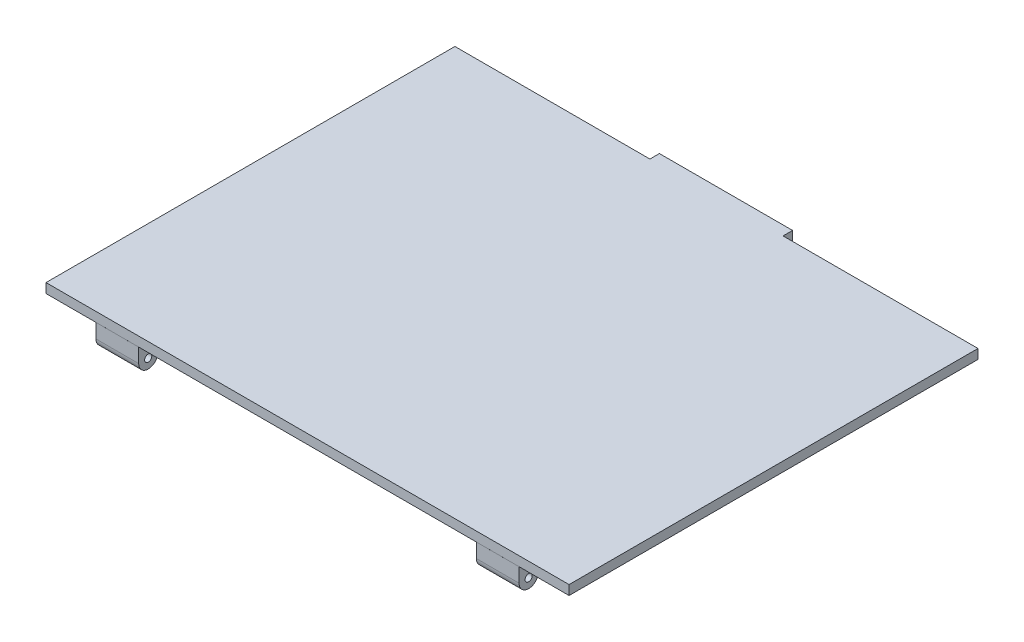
ISO-10303-21;
HEADER;
FILE_DESCRIPTION(('STEP AP214'),'2;1');
FILE_NAME('part.step','',(''),(''),'','','');
FILE_SCHEMA(('AUTOMOTIVE_DESIGN { 1 0 10303 214 1 1 1 1 }'));
ENDSEC;
DATA;
#1=APPLICATION_CONTEXT('core data for automotive mechanical design processes');
#2=APPLICATION_PROTOCOL_DEFINITION('international standard','automotive_design',2000,#1);
#3=PRODUCT_CONTEXT('',#1,'mechanical');
#4=PRODUCT('Part','Part','',(#3));
#5=PRODUCT_RELATED_PRODUCT_CATEGORY('part','',(#4));
#6=PRODUCT_DEFINITION_FORMATION('','',#4);
#7=PRODUCT_DEFINITION_CONTEXT('part definition',#1,'design');
#8=PRODUCT_DEFINITION('design','',#6,#7);
#9=PRODUCT_DEFINITION_SHAPE('','',#8);
#10=(LENGTH_UNIT() NAMED_UNIT(*) SI_UNIT(.MILLI.,.METRE.));
#11=(NAMED_UNIT(*) PLANE_ANGLE_UNIT() SI_UNIT($,.RADIAN.));
#12=(NAMED_UNIT(*) SI_UNIT($,.STERADIAN.) SOLID_ANGLE_UNIT());
#13=UNCERTAINTY_MEASURE_WITH_UNIT(LENGTH_MEASURE(1.E-05),#10,'distance_accuracy_value','');
#14=(GEOMETRIC_REPRESENTATION_CONTEXT(3) GLOBAL_UNCERTAINTY_ASSIGNED_CONTEXT((#13)) GLOBAL_UNIT_ASSIGNED_CONTEXT((#10,
#11,#12)) REPRESENTATION_CONTEXT('',''));
#15=CARTESIAN_POINT('',(0.,0.,0.));
#16=DIRECTION('',(0.,0.,1.));
#17=DIRECTION('',(1.,0.,0.));
#18=AXIS2_PLACEMENT_3D('',#15,#16,#17);
#19=CARTESIAN_POINT('',(0.,0.,0.));
#20=DIRECTION('',(0.,-1.,0.));
#21=DIRECTION('',(0.,0.,-1.));
#22=AXIS2_PLACEMENT_3D('',#19,#20,#21);
#23=PLANE('',#22);
#24=DIRECTION('',(-1.,0.,0.));
#25=VECTOR('',#24,1.);
#26=CARTESIAN_POINT('',(94.5910035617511,0.,-84.5623146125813));
#27=LINE('',#26,#25);
#28=CARTESIAN_POINT('',(25.5930238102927,0.,-84.5623146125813));
#29=VERTEX_POINT('',#28);
#30=CARTESIAN_POINT('',(-15.4089964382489,0.,-84.5623146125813));
#31=VERTEX_POINT('',#30);
#32=EDGE_CURVE('E255',#29,#31,#27,.T.);
#33=ORIENTED_EDGE('',*,*,#32,.F.);
#34=DIRECTION('',(0.,0.,1.));
#35=VECTOR('',#34,1.);
#36=CARTESIAN_POINT('',(25.5930238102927,0.,-86.5632451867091));
#37=LINE('',#36,#35);
#38=CARTESIAN_POINT('',(25.5930238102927,0.,-84.0623146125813));
#39=VERTEX_POINT('',#38);
#40=EDGE_CURVE('E52',#29,#39,#37,.T.);
#41=ORIENTED_EDGE('',*,*,#40,.T.);
#42=DIRECTION('',(-1.,0.,0.));
#43=VECTOR('',#42,1.);
#44=CARTESIAN_POINT('',(53.5965449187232,0.,-84.0623146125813));
#45=LINE('',#44,#43);
#46=CARTESIAN_POINT('',(53.5965449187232,0.,-84.0623146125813));
#47=VERTEX_POINT('',#46);
#48=EDGE_CURVE('E346',#39,#47,#45,.F.);
#49=ORIENTED_EDGE('',*,*,#48,.T.);
#50=DIRECTION('',(0.,0.,-1.));
#51=VECTOR('',#50,1.);
#52=CARTESIAN_POINT('',(53.5965449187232,0.,-86.5632451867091));
#53=LINE('',#52,#51);
#54=CARTESIAN_POINT('',(53.5965449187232,0.,-84.5623146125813));
#55=VERTEX_POINT('',#54);
#56=EDGE_CURVE('E344',#47,#55,#53,.T.);
#57=ORIENTED_EDGE('',*,*,#56,.T.);
#58=CARTESIAN_POINT('',(94.5910035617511,0.,-84.5623146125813));
#59=VERTEX_POINT('',#58);
#60=EDGE_CURVE('E264',#59,#55,#27,.T.);
#61=ORIENTED_EDGE('',*,*,#60,.F.);
#62=DIRECTION('',(0.,0.,-1.));
#63=VECTOR('',#62,1.);
#64=CARTESIAN_POINT('',(94.5910035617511,0.,-84.5623146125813));
#65=LINE('',#64,#63);
#66=CARTESIAN_POINT('',(94.5910035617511,0.,1.43457997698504));
#67=VERTEX_POINT('',#66);
#68=EDGE_CURVE('E252',#67,#59,#65,.T.);
#69=ORIENTED_EDGE('',*,*,#68,.F.);
#70=DIRECTION('',(1.,0.,0.));
#71=VECTOR('',#70,1.);
#72=CARTESIAN_POINT('',(-15.4089964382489,0.,1.43457997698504));
#73=LINE('',#72,#71);
#74=CARTESIAN_POINT('',(84.0934463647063,0.,1.43457997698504));
#75=VERTEX_POINT('',#74);
#76=EDGE_CURVE('E237',#75,#67,#73,.T.);
#77=ORIENTED_EDGE('',*,*,#76,.F.);
#78=DIRECTION('',(0.,0.,1.));
#79=VECTOR('',#78,1.);
#80=CARTESIAN_POINT('',(84.0934463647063,0.,1.43683144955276));
#81=LINE('',#80,#79);
#82=CARTESIAN_POINT('',(84.0934463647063,0.,-2.56709054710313));
#83=VERTEX_POINT('',#82);
#84=EDGE_CURVE('E423',#83,#75,#81,.T.);
#85=ORIENTED_EDGE('',*,*,#84,.F.);
#86=DIRECTION('',(1.,0.,0.));
#87=VECTOR('',#86,1.);
#88=CARTESIAN_POINT('',(75.0891966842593,0.,-2.56709054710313));
#89=LINE('',#88,#87);
#90=CARTESIAN_POINT('',(75.0891966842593,0.,-2.56709054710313));
#91=VERTEX_POINT('',#90);
#92=EDGE_CURVE('E426',#91,#83,#89,.T.);
#93=ORIENTED_EDGE('',*,*,#92,.F.);
#94=DIRECTION('',(0.,0.,-1.));
#95=VECTOR('',#94,1.);
#96=CARTESIAN_POINT('',(75.0891966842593,0.,1.43683144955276));
#97=LINE('',#96,#95);
#98=CARTESIAN_POINT('',(75.0891966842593,0.,1.43457997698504));
#99=VERTEX_POINT('',#98);
#100=EDGE_CURVE('E432',#99,#91,#97,.T.);
#101=ORIENTED_EDGE('',*,*,#100,.F.);
#102=CARTESIAN_POINT('',(4.09079142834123,0.,1.43457997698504));
#103=VERTEX_POINT('',#102);
#104=EDGE_CURVE('E503',#103,#99,#73,.T.);
#105=ORIENTED_EDGE('',*,*,#104,.F.);
#106=DIRECTION('',(0.,0.,1.));
#107=VECTOR('',#106,1.);
#108=CARTESIAN_POINT('',(4.09079142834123,0.,1.43683144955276));
#109=LINE('',#108,#107);
#110=CARTESIAN_POINT('',(4.09079142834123,0.,-2.56709054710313));
#111=VERTEX_POINT('',#110);
#112=EDGE_CURVE('E453',#111,#103,#109,.T.);
#113=ORIENTED_EDGE('',*,*,#112,.F.);
#114=DIRECTION('',(1.,0.,0.));
#115=VECTOR('',#114,1.);
#116=CARTESIAN_POINT('',(-4.91225300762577,0.,-2.56709054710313));
#117=LINE('',#116,#115);
#118=CARTESIAN_POINT('',(-4.91225300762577,0.,-2.56709054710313));
#119=VERTEX_POINT('',#118);
#120=EDGE_CURVE('E456',#119,#111,#117,.T.);
#121=ORIENTED_EDGE('',*,*,#120,.F.);
#122=DIRECTION('',(0.,0.,-1.));
#123=VECTOR('',#122,1.);
#124=CARTESIAN_POINT('',(-4.91225300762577,0.,1.43683144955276));
#125=LINE('',#124,#123);
#126=CARTESIAN_POINT('',(-4.91225300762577,0.,1.43457997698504));
#127=VERTEX_POINT('',#126);
#128=EDGE_CURVE('E243',#127,#119,#125,.T.);
#129=ORIENTED_EDGE('',*,*,#128,.F.);
#130=CARTESIAN_POINT('',(-15.4089964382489,0.,1.43457997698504));
#131=VERTEX_POINT('',#130);
#132=EDGE_CURVE('E229',#131,#127,#73,.T.);
#133=ORIENTED_EDGE('',*,*,#132,.F.);
#134=DIRECTION('',(0.,0.,1.));
#135=VECTOR('',#134,1.);
#136=CARTESIAN_POINT('',(-15.4089964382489,0.,-84.5623146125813));
#137=LINE('',#136,#135);
#138=EDGE_CURVE('E241',#31,#131,#137,.T.);
#139=ORIENTED_EDGE('',*,*,#138,.F.);
#140=EDGE_LOOP('',(#33,#41,#49,#57,#61,#69,#77,#85,#93,#101,#105,#113,#121,#129,#133,#139));
#141=FACE_BOUND('',#140,.T.);
#142=ADVANCED_FACE('F37',(#141),#23,.T.);
#143=CARTESIAN_POINT('',(-15.4089964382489,2.,-84.5623146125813));
#144=DIRECTION('',(1.,0.,0.));
#145=DIRECTION('',(0.,0.,-1.));
#146=AXIS2_PLACEMENT_3D('',#143,#144,#145);
#147=PLANE('',#146);
#148=DIRECTION('',(0.,-1.,0.));
#149=VECTOR('',#148,1.);
#150=CARTESIAN_POINT('',(-15.4089964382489,2.,1.43457997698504));
#151=LINE('',#150,#149);
#152=CARTESIAN_POINT('',(-15.4089964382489,2.,1.43457997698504));
#153=VERTEX_POINT('',#152);
#154=EDGE_CURVE('E225',#153,#131,#151,.T.);
#155=ORIENTED_EDGE('',*,*,#154,.F.);
#156=DIRECTION('',(0.,0.,1.));
#157=VECTOR('',#156,1.);
#158=CARTESIAN_POINT('',(-15.4089964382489,2.,-84.5623146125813));
#159=LINE('',#158,#157);
#160=CARTESIAN_POINT('',(-15.4089964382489,2.,-84.5623146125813));
#161=VERTEX_POINT('',#160);
#162=EDGE_CURVE('E267',#161,#153,#159,.T.);
#163=ORIENTED_EDGE('',*,*,#162,.F.);
#164=DIRECTION('',(0.,-1.,0.));
#165=VECTOR('',#164,1.);
#166=CARTESIAN_POINT('',(-15.4089964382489,2.,-84.5623146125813));
#167=LINE('',#166,#165);
#168=EDGE_CURVE('E251',#161,#31,#167,.T.);
#169=ORIENTED_EDGE('',*,*,#168,.T.);
#170=ORIENTED_EDGE('',*,*,#138,.T.);
#171=EDGE_LOOP('',(#155,#163,#169,#170));
#172=FACE_BOUND('',#171,.T.);
#173=ADVANCED_FACE('F249',(#172),#147,.F.);
#174=CARTESIAN_POINT('',(94.5910035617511,2.,-84.5623146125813));
#175=DIRECTION('',(-1.,0.,0.));
#176=DIRECTION('',(0.,0.,1.));
#177=AXIS2_PLACEMENT_3D('',#174,#175,#176);
#178=PLANE('',#177);
#179=DIRECTION('',(0.,1.,0.));
#180=VECTOR('',#179,1.);
#181=CARTESIAN_POINT('',(94.5910035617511,2.,1.43457997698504));
#182=LINE('',#181,#180);
#183=CARTESIAN_POINT('',(94.5910035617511,2.,1.43457997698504));
#184=VERTEX_POINT('',#183);
#185=EDGE_CURVE('E245',#67,#184,#182,.T.);
#186=ORIENTED_EDGE('',*,*,#185,.F.);
#187=ORIENTED_EDGE('',*,*,#68,.T.);
#188=DIRECTION('',(0.,-1.,0.));
#189=VECTOR('',#188,1.);
#190=CARTESIAN_POINT('',(94.5910035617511,2.,-84.5623146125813));
#191=LINE('',#190,#189);
#192=CARTESIAN_POINT('',(94.5910035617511,2.,-84.5623146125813));
#193=VERTEX_POINT('',#192);
#194=EDGE_CURVE('E269',#193,#59,#191,.T.);
#195=ORIENTED_EDGE('',*,*,#194,.F.);
#196=DIRECTION('',(0.,0.,-1.));
#197=VECTOR('',#196,1.);
#198=CARTESIAN_POINT('',(94.5910035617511,2.,-84.5623146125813));
#199=LINE('',#198,#197);
#200=EDGE_CURVE('E376',#184,#193,#199,.T.);
#201=ORIENTED_EDGE('',*,*,#200,.F.);
#202=EDGE_LOOP('',(#186,#187,#195,#201));
#203=FACE_BOUND('',#202,.T.);
#204=ADVANCED_FACE('F484',(#203),#178,.F.);
#205=CARTESIAN_POINT('',(0.,2.,0.));
#206=DIRECTION('',(0.,-1.,0.));
#207=DIRECTION('',(0.,0.,-1.));
#208=AXIS2_PLACEMENT_3D('',#205,#206,#207);
#209=PLANE('',#208);
#210=DIRECTION('',(-1.,0.,0.));
#211=VECTOR('',#210,1.);
#212=CARTESIAN_POINT('',(-15.4089964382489,2.,1.43457997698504));
#213=LINE('',#212,#211);
#214=EDGE_CURVE('E232',#184,#153,#213,.T.);
#215=ORIENTED_EDGE('',*,*,#214,.F.);
#216=ORIENTED_EDGE('',*,*,#200,.T.);
#217=DIRECTION('',(-1.,0.,0.));
#218=VECTOR('',#217,1.);
#219=CARTESIAN_POINT('',(94.5910035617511,2.,-84.5623146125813));
#220=LINE('',#219,#218);
#221=CARTESIAN_POINT('',(53.5965449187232,2.,-84.5623146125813));
#222=VERTEX_POINT('',#221);
#223=EDGE_CURVE('E261',#193,#222,#220,.T.);
#224=ORIENTED_EDGE('',*,*,#223,.T.);
#225=DIRECTION('',(0.,0.,1.));
#226=VECTOR('',#225,1.);
#227=CARTESIAN_POINT('',(53.5965449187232,2.,-86.5632451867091));
#228=LINE('',#227,#226);
#229=CARTESIAN_POINT('',(53.5965449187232,2.,-86.5632451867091));
#230=VERTEX_POINT('',#229);
#231=EDGE_CURVE('E375',#230,#222,#228,.T.);
#232=ORIENTED_EDGE('',*,*,#231,.F.);
#233=DIRECTION('',(1.,0.,0.));
#234=VECTOR('',#233,1.);
#235=CARTESIAN_POINT('',(53.5965449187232,2.,-86.5632451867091));
#236=LINE('',#235,#234);
#237=CARTESIAN_POINT('',(25.5930238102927,2.,-86.5632451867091));
#238=VERTEX_POINT('',#237);
#239=EDGE_CURVE('E390',#238,#230,#236,.T.);
#240=ORIENTED_EDGE('',*,*,#239,.F.);
#241=DIRECTION('',(0.,0.,-1.));
#242=VECTOR('',#241,1.);
#243=CARTESIAN_POINT('',(25.5930238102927,2.,-86.5632451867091));
#244=LINE('',#243,#242);
#245=CARTESIAN_POINT('',(25.5930238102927,2.,-84.5623146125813));
#246=VERTEX_POINT('',#245);
#247=EDGE_CURVE('E391',#246,#238,#244,.T.);
#248=ORIENTED_EDGE('',*,*,#247,.F.);
#249=EDGE_CURVE('E377',#246,#161,#220,.T.);
#250=ORIENTED_EDGE('',*,*,#249,.T.);
#251=ORIENTED_EDGE('',*,*,#162,.T.);
#252=EDGE_LOOP('',(#215,#216,#224,#232,#240,#248,#250,#251));
#253=FACE_BOUND('',#252,.T.);
#254=ADVANCED_FACE('F386',(#253),#209,.F.);
#255=CARTESIAN_POINT('',(53.5965449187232,2.,-84.5623146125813));
#256=DIRECTION('',(0.,0.,1.));
#257=DIRECTION('',(1.,0.,0.));
#258=AXIS2_PLACEMENT_3D('',#255,#256,#257);
#259=PLANE('',#258);
#260=DIRECTION('',(0.,-1.,0.));
#261=VECTOR('',#260,1.);
#262=CARTESIAN_POINT('',(53.5965449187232,2.,-84.5623146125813));
#263=LINE('',#262,#261);
#264=CARTESIAN_POINT('',(53.5965449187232,-0.5,-84.5623146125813));
#265=VERTEX_POINT('',#264);
#266=CARTESIAN_POINT('',(53.5965449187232,-2.99789397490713,-84.5623146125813));
#267=VERTEX_POINT('',#266);
#268=EDGE_CURVE('E357',#265,#267,#263,.T.);
#269=ORIENTED_EDGE('',*,*,#268,.F.);
#270=DIRECTION('',(-1.,0.,0.));
#271=VECTOR('',#270,1.);
#272=CARTESIAN_POINT('',(25.5930238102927,-0.5,-84.5623146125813));
#273=LINE('',#272,#271);
#274=CARTESIAN_POINT('',(25.5930238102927,-0.5,-84.5623146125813));
#275=VERTEX_POINT('',#274);
#276=EDGE_CURVE('E336',#265,#275,#273,.T.);
#277=ORIENTED_EDGE('',*,*,#276,.T.);
#278=DIRECTION('',(0.,-1.,0.));
#279=VECTOR('',#278,1.);
#280=CARTESIAN_POINT('',(25.5930238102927,2.,-84.5623146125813));
#281=LINE('',#280,#279);
#282=CARTESIAN_POINT('',(25.5930238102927,-2.99789397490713,-84.5623146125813));
#283=VERTEX_POINT('',#282);
#284=EDGE_CURVE('E258',#275,#283,#281,.T.);
#285=ORIENTED_EDGE('',*,*,#284,.T.);
#286=DIRECTION('',(-1.,0.,0.));
#287=VECTOR('',#286,1.);
#288=CARTESIAN_POINT('',(25.5930238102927,-2.99789397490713,-84.5623146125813));
#289=LINE('',#288,#287);
#290=EDGE_CURVE('E363',#267,#283,#289,.T.);
#291=ORIENTED_EDGE('',*,*,#290,.F.);
#292=EDGE_LOOP('',(#269,#277,#285,#291));
#293=FACE_BOUND('',#292,.T.);
#294=ADVANCED_FACE('F361',(#293),#259,.T.);
#295=CARTESIAN_POINT('',(94.5910035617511,2.,-84.5623146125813));
#296=DIRECTION('',(0.,0.,1.));
#297=DIRECTION('',(1.,0.,0.));
#298=AXIS2_PLACEMENT_3D('',#295,#296,#297);
#299=PLANE('',#298);
#300=EDGE_CURVE('E365',#222,#55,#263,.T.);
#301=ORIENTED_EDGE('',*,*,#300,.F.);
#302=ORIENTED_EDGE('',*,*,#223,.F.);
#303=ORIENTED_EDGE('',*,*,#194,.T.);
#304=ORIENTED_EDGE('',*,*,#60,.T.);
#305=EDGE_LOOP('',(#301,#302,#303,#304));
#306=FACE_BOUND('',#305,.T.);
#307=ADVANCED_FACE('F486',(#306),#299,.F.);
#308=ORIENTED_EDGE('',*,*,#249,.F.);
#309=EDGE_CURVE('E253',#246,#29,#281,.T.);
#310=ORIENTED_EDGE('',*,*,#309,.T.);
#311=ORIENTED_EDGE('',*,*,#32,.T.);
#312=ORIENTED_EDGE('',*,*,#168,.F.);
#313=EDGE_LOOP('',(#308,#310,#311,#312));
#314=FACE_BOUND('',#313,.T.);
#315=ADVANCED_FACE('F559',(#314),#299,.F.);
#316=CARTESIAN_POINT('',(25.5930238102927,2.,-86.5632451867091));
#317=DIRECTION('',(-1.,0.,0.));
#318=DIRECTION('',(0.,0.,1.));
#319=AXIS2_PLACEMENT_3D('',#316,#317,#318);
#320=PLANE('',#319);
#321=DIRECTION('',(0.,-1.,0.));
#322=VECTOR('',#321,1.);
#323=CARTESIAN_POINT('',(25.5930238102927,2.,-86.5632451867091));
#324=LINE('',#323,#322);
#325=CARTESIAN_POINT('',(25.5930238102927,-5.,-86.5632451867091));
#326=VERTEX_POINT('',#325);
#327=EDGE_CURVE('E369',#238,#326,#324,.T.);
#328=ORIENTED_EDGE('',*,*,#327,.T.);
#329=CARTESIAN_POINT('',(25.5930238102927,-5.,-85.5632451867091));
#330=DIRECTION('',(-1.,0.,0.));
#331=DIRECTION('',(0.,0.,1.));
#332=AXIS2_PLACEMENT_3D('',#329,#330,#331);
#333=CIRCLE('',#332,1.);
#334=CARTESIAN_POINT('',(25.5930238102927,-6.,-85.5632451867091));
#335=VERTEX_POINT('',#334);
#336=EDGE_CURVE('E298',#326,#335,#333,.T.);
#337=ORIENTED_EDGE('',*,*,#336,.T.);
#338=DIRECTION('',(0.,0.,-1.));
#339=VECTOR('',#338,1.);
#340=CARTESIAN_POINT('',(25.5930238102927,-6.,-86.5632451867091));
#341=LINE('',#340,#339);
#342=CARTESIAN_POINT('',(25.5930238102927,-6.,-85.5623146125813));
#343=VERTEX_POINT('',#342);
#344=EDGE_CURVE('E398',#343,#335,#341,.T.);
#345=ORIENTED_EDGE('',*,*,#344,.F.);
#346=CARTESIAN_POINT('',(25.5930238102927,-4.,-85.5623146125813));
#347=DIRECTION('',(-1.,0.,0.));
#348=DIRECTION('',(0.,0.,1.));
#349=AXIS2_PLACEMENT_3D('',#346,#347,#348);
#350=CIRCLE('',#349,2.);
#351=CARTESIAN_POINT('',(25.5930238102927,-4.,-83.5623146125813));
#352=VERTEX_POINT('',#351);
#353=EDGE_CURVE('E289',#343,#352,#350,.T.);
#354=ORIENTED_EDGE('',*,*,#353,.T.);
#355=DIRECTION('',(0.,-1.,0.));
#356=VECTOR('',#355,1.);
#357=CARTESIAN_POINT('',(25.5930238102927,-2.99789397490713,-83.5623146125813));
#358=LINE('',#357,#356);
#359=CARTESIAN_POINT('',(25.5930238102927,-3.99789397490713,-83.5623146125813));
#360=VERTEX_POINT('',#359);
#361=EDGE_CURVE('E401',#360,#352,#358,.T.);
#362=ORIENTED_EDGE('',*,*,#361,.F.);
#363=CARTESIAN_POINT('',(25.5930238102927,-3.99789397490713,-84.5623146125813));
#364=DIRECTION('',(-1.,0.,0.));
#365=DIRECTION('',(0.,0.,1.));
#366=AXIS2_PLACEMENT_3D('',#363,#364,#365);
#367=CIRCLE('',#366,1.);
#368=EDGE_CURVE('E275',#360,#283,#367,.T.);
#369=ORIENTED_EDGE('',*,*,#368,.T.);
#370=ORIENTED_EDGE('',*,*,#284,.F.);
#371=CARTESIAN_POINT('',(25.5930238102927,-0.5,-84.0623146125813));
#372=DIRECTION('',(-1.,0.,0.));
#373=DIRECTION('',(0.,0.,1.));
#374=AXIS2_PLACEMENT_3D('',#371,#372,#373);
#375=CIRCLE('',#374,0.5);
#376=EDGE_CURVE('E45',#275,#39,#375,.F.);
#377=ORIENTED_EDGE('',*,*,#376,.T.);
#378=ORIENTED_EDGE('',*,*,#40,.F.);
#379=ORIENTED_EDGE('',*,*,#309,.F.);
#380=ORIENTED_EDGE('',*,*,#247,.T.);
#381=EDGE_LOOP('',(#328,#337,#345,#354,#362,#369,#370,#377,#378,#379,#380));
#382=FACE_BOUND('',#381,.T.);
#383=ADVANCED_FACE('F562',(#382),#320,.T.);
#384=CARTESIAN_POINT('',(53.5965449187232,2.,-86.5632451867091));
#385=DIRECTION('',(1.,0.,0.));
#386=DIRECTION('',(0.,0.,-1.));
#387=AXIS2_PLACEMENT_3D('',#384,#385,#386);
#388=PLANE('',#387);
#389=DIRECTION('',(0.,0.,1.));
#390=VECTOR('',#389,1.);
#391=CARTESIAN_POINT('',(53.5965449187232,-6.,-86.5632451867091));
#392=LINE('',#391,#390);
#393=CARTESIAN_POINT('',(53.5965449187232,-6.,-85.5632451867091));
#394=VERTEX_POINT('',#393);
#395=CARTESIAN_POINT('',(53.5965449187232,-6.,-85.5623146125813));
#396=VERTEX_POINT('',#395);
#397=EDGE_CURVE('E396',#394,#396,#392,.T.);
#398=ORIENTED_EDGE('',*,*,#397,.F.);
#399=CARTESIAN_POINT('',(53.5965449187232,-5.,-85.5632451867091));
#400=DIRECTION('',(1.,0.,0.));
#401=DIRECTION('',(0.,0.,-1.));
#402=AXIS2_PLACEMENT_3D('',#399,#400,#401);
#403=CIRCLE('',#402,1.);
#404=CARTESIAN_POINT('',(53.5965449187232,-5.,-86.5632451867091));
#405=VERTEX_POINT('',#404);
#406=EDGE_CURVE('E294',#394,#405,#403,.T.);
#407=ORIENTED_EDGE('',*,*,#406,.T.);
#408=DIRECTION('',(0.,-1.,0.));
#409=VECTOR('',#408,1.);
#410=CARTESIAN_POINT('',(53.5965449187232,2.,-86.5632451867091));
#411=LINE('',#410,#409);
#412=EDGE_CURVE('E366',#230,#405,#411,.T.);
#413=ORIENTED_EDGE('',*,*,#412,.F.);
#414=ORIENTED_EDGE('',*,*,#231,.T.);
#415=ORIENTED_EDGE('',*,*,#300,.T.);
#416=ORIENTED_EDGE('',*,*,#56,.F.);
#417=CARTESIAN_POINT('',(53.5965449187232,-0.5,-84.0623146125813));
#418=DIRECTION('',(1.,0.,0.));
#419=DIRECTION('',(0.,0.,-1.));
#420=AXIS2_PLACEMENT_3D('',#417,#418,#419);
#421=CIRCLE('',#420,0.5);
#422=EDGE_CURVE('E12',#47,#265,#421,.F.);
#423=ORIENTED_EDGE('',*,*,#422,.T.);
#424=ORIENTED_EDGE('',*,*,#268,.T.);
#425=CARTESIAN_POINT('',(53.5965449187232,-3.99789397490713,-84.5623146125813));
#426=DIRECTION('',(1.,0.,0.));
#427=DIRECTION('',(0.,0.,-1.));
#428=AXIS2_PLACEMENT_3D('',#425,#426,#427);
#429=CIRCLE('',#428,1.);
#430=CARTESIAN_POINT('',(53.5965449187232,-3.99789397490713,-83.5623146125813));
#431=VERTEX_POINT('',#430);
#432=EDGE_CURVE('E278',#267,#431,#429,.T.);
#433=ORIENTED_EDGE('',*,*,#432,.T.);
#434=DIRECTION('',(0.,1.,0.));
#435=VECTOR('',#434,1.);
#436=CARTESIAN_POINT('',(53.5965449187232,-2.99789397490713,-83.5623146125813));
#437=LINE('',#436,#435);
#438=CARTESIAN_POINT('',(53.5965449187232,-4.,-83.5623146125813));
#439=VERTEX_POINT('',#438);
#440=EDGE_CURVE('E403',#439,#431,#437,.T.);
#441=ORIENTED_EDGE('',*,*,#440,.F.);
#442=CARTESIAN_POINT('',(53.5965449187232,-4.,-85.5623146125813));
#443=DIRECTION('',(1.,0.,0.));
#444=DIRECTION('',(0.,0.,-1.));
#445=AXIS2_PLACEMENT_3D('',#442,#443,#444);
#446=CIRCLE('',#445,2.);
#447=EDGE_CURVE('E284',#439,#396,#446,.T.);
#448=ORIENTED_EDGE('',*,*,#447,.T.);
#449=EDGE_LOOP('',(#398,#407,#413,#414,#415,#416,#423,#424,#433,#441,#448));
#450=FACE_BOUND('',#449,.T.);
#451=ADVANCED_FACE('F356',(#450),#388,.T.);
#452=CARTESIAN_POINT('',(53.5965449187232,2.,-86.5632451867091));
#453=DIRECTION('',(0.,0.,-1.));
#454=DIRECTION('',(-1.,0.,0.));
#455=AXIS2_PLACEMENT_3D('',#452,#453,#454);
#456=PLANE('',#455);
#457=ORIENTED_EDGE('',*,*,#412,.T.);
#458=DIRECTION('',(1.,0.,0.));
#459=VECTOR('',#458,1.);
#460=CARTESIAN_POINT('',(53.5965449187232,-5.,-86.5632451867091));
#461=LINE('',#460,#459);
#462=EDGE_CURVE('E296',#405,#326,#461,.F.);
#463=ORIENTED_EDGE('',*,*,#462,.T.);
#464=ORIENTED_EDGE('',*,*,#327,.F.);
#465=ORIENTED_EDGE('',*,*,#239,.T.);
#466=EDGE_LOOP('',(#457,#463,#464,#465));
#467=FACE_BOUND('',#466,.T.);
#468=ADVANCED_FACE('F621',(#467),#456,.T.);
#469=CARTESIAN_POINT('',(0.,-6.,0.));
#470=DIRECTION('',(0.,-1.,0.));
#471=DIRECTION('',(0.,0.,-1.));
#472=AXIS2_PLACEMENT_3D('',#469,#470,#471);
#473=PLANE('',#472);
#474=ORIENTED_EDGE('',*,*,#344,.T.);
#475=DIRECTION('',(1.,0.,0.));
#476=VECTOR('',#475,1.);
#477=CARTESIAN_POINT('',(0.,-6.,-85.5632451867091));
#478=LINE('',#477,#476);
#479=EDGE_CURVE('E291',#335,#394,#478,.T.);
#480=ORIENTED_EDGE('',*,*,#479,.T.);
#481=ORIENTED_EDGE('',*,*,#397,.T.);
#482=DIRECTION('',(1.,0.,0.));
#483=VECTOR('',#482,1.);
#484=CARTESIAN_POINT('',(0.,-6.,-85.5623146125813));
#485=LINE('',#484,#483);
#486=EDGE_CURVE('E287',#396,#343,#485,.F.);
#487=ORIENTED_EDGE('',*,*,#486,.T.);
#488=EDGE_LOOP('',(#474,#480,#481,#487));
#489=FACE_BOUND('',#488,.T.);
#490=ADVANCED_FACE('F617',(#489),#473,.T.);
#491=CARTESIAN_POINT('',(0.,0.,-83.5623146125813));
#492=DIRECTION('',(0.,0.,1.));
#493=DIRECTION('',(1.,0.,0.));
#494=AXIS2_PLACEMENT_3D('',#491,#492,#493);
#495=PLANE('',#494);
#496=ORIENTED_EDGE('',*,*,#361,.T.);
#497=DIRECTION('',(1.,0.,0.));
#498=VECTOR('',#497,1.);
#499=CARTESIAN_POINT('',(0.,-4.,-83.5623146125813));
#500=LINE('',#499,#498);
#501=EDGE_CURVE('E281',#352,#439,#500,.T.);
#502=ORIENTED_EDGE('',*,*,#501,.T.);
#503=ORIENTED_EDGE('',*,*,#440,.T.);
#504=DIRECTION('',(-1.,0.,0.));
#505=VECTOR('',#504,1.);
#506=CARTESIAN_POINT('',(25.5930238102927,-3.99789397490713,-83.5623146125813));
#507=LINE('',#506,#505);
#508=EDGE_CURVE('E272',#431,#360,#507,.T.);
#509=ORIENTED_EDGE('',*,*,#508,.T.);
#510=EDGE_LOOP('',(#496,#502,#503,#509));
#511=FACE_BOUND('',#510,.T.);
#512=ADVANCED_FACE('F570',(#511),#495,.T.);
#513=CARTESIAN_POINT('',(0.,-3.99789397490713,-84.5623146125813));
#514=DIRECTION('',(1.,0.,0.));
#515=DIRECTION('',(0.,0.,-1.));
#516=AXIS2_PLACEMENT_3D('',#513,#514,#515);
#517=CYLINDRICAL_SURFACE('',#516,1.);
#518=ORIENTED_EDGE('',*,*,#432,.F.);
#519=ORIENTED_EDGE('',*,*,#290,.T.);
#520=ORIENTED_EDGE('',*,*,#368,.F.);
#521=ORIENTED_EDGE('',*,*,#508,.F.);
#522=EDGE_LOOP('',(#518,#519,#520,#521));
#523=FACE_BOUND('',#522,.T.);
#524=ADVANCED_FACE('F566',(#523),#517,.T.);
#525=CARTESIAN_POINT('',(0.,-4.,-85.5623146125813));
#526=DIRECTION('',(1.,0.,0.));
#527=DIRECTION('',(0.,0.,-1.));
#528=AXIS2_PLACEMENT_3D('',#525,#526,#527);
#529=CYLINDRICAL_SURFACE('',#528,2.);
#530=ORIENTED_EDGE('',*,*,#353,.F.);
#531=ORIENTED_EDGE('',*,*,#486,.F.);
#532=ORIENTED_EDGE('',*,*,#447,.F.);
#533=ORIENTED_EDGE('',*,*,#501,.F.);
#534=EDGE_LOOP('',(#530,#531,#532,#533));
#535=FACE_BOUND('',#534,.T.);
#536=ADVANCED_FACE('F569',(#535),#529,.T.);
#537=CARTESIAN_POINT('',(0.,-5.,-85.5632451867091));
#538=DIRECTION('',(1.,0.,0.));
#539=DIRECTION('',(0.,0.,-1.));
#540=AXIS2_PLACEMENT_3D('',#537,#538,#539);
#541=CYLINDRICAL_SURFACE('',#540,1.);
#542=ORIENTED_EDGE('',*,*,#336,.F.);
#543=ORIENTED_EDGE('',*,*,#462,.F.);
#544=ORIENTED_EDGE('',*,*,#406,.F.);
#545=ORIENTED_EDGE('',*,*,#479,.F.);
#546=EDGE_LOOP('',(#542,#543,#544,#545));
#547=FACE_BOUND('',#546,.T.);
#548=ADVANCED_FACE('F574',(#547),#541,.T.);
#549=CARTESIAN_POINT('',(75.0891966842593,-5.,1.43683144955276));
#550=DIRECTION('',(1.,0.,0.));
#551=DIRECTION('',(0.,0.,-1.));
#552=AXIS2_PLACEMENT_3D('',#549,#550,#551);
#553=PLANE('',#552);
#554=CARTESIAN_POINT('',(75.0891966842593,-2.9980042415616,-0.56512954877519));
#555=DIRECTION('',(1.,0.,0.));
#556=DIRECTION('',(0.,0.,-1.));
#557=AXIS2_PLACEMENT_3D('',#554,#555,#556);
#558=CIRCLE('',#557,0.75);
#559=CARTESIAN_POINT('',(75.0891966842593,-2.9980042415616,-1.31512954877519));
#560=VERTEX_POINT('',#559);
#561=EDGE_CURVE('E465',#560,#560,#558,.T.);
#562=ORIENTED_EDGE('',*,*,#561,.T.);
#563=EDGE_LOOP('',(#562));
#564=FACE_BOUND('',#563,.T.);
#565=DIRECTION('',(0.,0.,-1.));
#566=VECTOR('',#565,1.);
#567=CARTESIAN_POINT('',(75.0891966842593,-5.,1.43683144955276));
#568=LINE('',#567,#566);
#569=CARTESIAN_POINT('',(75.0891966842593,-5.,-0.553168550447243));
#570=VERTEX_POINT('',#569);
#571=CARTESIAN_POINT('',(75.0891966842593,-5.,-0.577090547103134));
#572=VERTEX_POINT('',#571);
#573=EDGE_CURVE('E422',#570,#572,#568,.T.);
#574=ORIENTED_EDGE('',*,*,#573,.F.);
#575=CARTESIAN_POINT('',(75.0891966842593,-3.01,-0.553168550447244));
#576=DIRECTION('',(1.,0.,0.));
#577=DIRECTION('',(0.,0.,-1.));
#578=AXIS2_PLACEMENT_3D('',#575,#576,#577);
#579=CIRCLE('',#578,1.99);
#580=CARTESIAN_POINT('',(75.0891966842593,-3.01,1.43683144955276));
#581=VERTEX_POINT('',#580);
#582=EDGE_CURVE('E326',#570,#581,#579,.F.);
#583=ORIENTED_EDGE('',*,*,#582,.T.);
#584=DIRECTION('',(0.,1.,0.));
#585=VECTOR('',#584,1.);
#586=CARTESIAN_POINT('',(75.0891966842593,-5.,1.43683144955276));
#587=LINE('',#586,#585);
#588=CARTESIAN_POINT('',(75.0891966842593,0.,1.43683144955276));
#589=VERTEX_POINT('',#588);
#590=EDGE_CURVE('E415',#581,#589,#587,.T.);
#591=ORIENTED_EDGE('',*,*,#590,.T.);
#592=EDGE_CURVE('E429',#589,#99,#97,.T.);
#593=ORIENTED_EDGE('',*,*,#592,.T.);
#594=ORIENTED_EDGE('',*,*,#100,.T.);
#595=DIRECTION('',(0.,1.,0.));
#596=VECTOR('',#595,1.);
#597=CARTESIAN_POINT('',(75.0891966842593,-5.,-2.56709054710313));
#598=LINE('',#597,#596);
#599=CARTESIAN_POINT('',(75.0891966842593,-3.01,-2.56709054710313));
#600=VERTEX_POINT('',#599);
#601=EDGE_CURVE('E404',#600,#91,#598,.T.);
#602=ORIENTED_EDGE('',*,*,#601,.F.);
#603=CARTESIAN_POINT('',(75.0891966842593,-3.01,-0.577090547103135));
#604=DIRECTION('',(1.,0.,0.));
#605=DIRECTION('',(0.,0.,-1.));
#606=AXIS2_PLACEMENT_3D('',#603,#604,#605);
#607=CIRCLE('',#606,1.99);
#608=EDGE_CURVE('E324',#600,#572,#607,.F.);
#609=ORIENTED_EDGE('',*,*,#608,.T.);
#610=EDGE_LOOP('',(#574,#583,#591,#593,#594,#602,#609));
#611=FACE_BOUND('',#610,.T.);
#612=ADVANCED_FACE('F506',(#564,#611),#553,.F.);
#613=CARTESIAN_POINT('',(75.0891966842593,-5.,-2.56709054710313));
#614=DIRECTION('',(0.,0.,1.));
#615=DIRECTION('',(1.,0.,0.));
#616=AXIS2_PLACEMENT_3D('',#613,#614,#615);
#617=PLANE('',#616);
#618=DIRECTION('',(0.,1.,0.));
#619=VECTOR('',#618,1.);
#620=CARTESIAN_POINT('',(84.0934463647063,-5.,-2.56709054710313));
#621=LINE('',#620,#619);
#622=CARTESIAN_POINT('',(84.0934463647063,-3.01,-2.56709054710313));
#623=VERTEX_POINT('',#622);
#624=EDGE_CURVE('E410',#623,#83,#621,.T.);
#625=ORIENTED_EDGE('',*,*,#624,.F.);
#626=DIRECTION('',(1.,0.,0.));
#627=VECTOR('',#626,1.);
#628=CARTESIAN_POINT('',(75.0891966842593,-3.01,-2.56709054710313));
#629=LINE('',#628,#627);
#630=EDGE_CURVE('E334',#623,#600,#629,.F.);
#631=ORIENTED_EDGE('',*,*,#630,.T.);
#632=ORIENTED_EDGE('',*,*,#601,.T.);
#633=ORIENTED_EDGE('',*,*,#92,.T.);
#634=EDGE_LOOP('',(#625,#631,#632,#633));
#635=FACE_BOUND('',#634,.T.);
#636=ADVANCED_FACE('F497',(#635),#617,.F.);
#637=CARTESIAN_POINT('',(84.0934463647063,-5.,1.43683144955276));
#638=DIRECTION('',(-1.,0.,0.));
#639=DIRECTION('',(0.,0.,1.));
#640=AXIS2_PLACEMENT_3D('',#637,#638,#639);
#641=PLANE('',#640);
#642=CARTESIAN_POINT('',(84.0934463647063,-2.9980042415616,-0.56512954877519));
#643=DIRECTION('',(1.,0.,0.));
#644=DIRECTION('',(0.,0.,-1.));
#645=AXIS2_PLACEMENT_3D('',#642,#643,#644);
#646=CIRCLE('',#645,0.75);
#647=CARTESIAN_POINT('',(84.0934463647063,-2.9980042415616,-1.31512954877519));
#648=VERTEX_POINT('',#647);
#649=EDGE_CURVE('E341',#648,#648,#646,.T.);
#650=ORIENTED_EDGE('',*,*,#649,.F.);
#651=EDGE_LOOP('',(#650));
#652=FACE_BOUND('',#651,.T.);
#653=DIRECTION('',(0.,1.,0.));
#654=VECTOR('',#653,1.);
#655=CARTESIAN_POINT('',(84.0934463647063,-5.,1.43683144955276));
#656=LINE('',#655,#654);
#657=CARTESIAN_POINT('',(84.0934463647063,-3.01,1.43683144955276));
#658=VERTEX_POINT('',#657);
#659=CARTESIAN_POINT('',(84.0934463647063,0.,1.43683144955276));
#660=VERTEX_POINT('',#659);
#661=EDGE_CURVE('E412',#658,#660,#656,.T.);
#662=ORIENTED_EDGE('',*,*,#661,.F.);
#663=CARTESIAN_POINT('',(84.0934463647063,-3.01,-0.553168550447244));
#664=DIRECTION('',(-1.,0.,0.));
#665=DIRECTION('',(0.,0.,1.));
#666=AXIS2_PLACEMENT_3D('',#663,#664,#665);
#667=CIRCLE('',#666,1.99);
#668=CARTESIAN_POINT('',(84.0934463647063,-5.,-0.553168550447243));
#669=VERTEX_POINT('',#668);
#670=EDGE_CURVE('E332',#658,#669,#667,.F.);
#671=ORIENTED_EDGE('',*,*,#670,.T.);
#672=DIRECTION('',(0.,0.,1.));
#673=VECTOR('',#672,1.);
#674=CARTESIAN_POINT('',(84.0934463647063,-5.,1.43683144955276));
#675=LINE('',#674,#673);
#676=CARTESIAN_POINT('',(84.0934463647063,-5.,-0.577090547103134));
#677=VERTEX_POINT('',#676);
#678=EDGE_CURVE('E418',#677,#669,#675,.T.);
#679=ORIENTED_EDGE('',*,*,#678,.F.);
#680=CARTESIAN_POINT('',(84.0934463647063,-3.01,-0.577090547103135));
#681=DIRECTION('',(-1.,0.,0.));
#682=DIRECTION('',(0.,0.,1.));
#683=AXIS2_PLACEMENT_3D('',#680,#681,#682);
#684=CIRCLE('',#683,1.99);
#685=EDGE_CURVE('E330',#677,#623,#684,.F.);
#686=ORIENTED_EDGE('',*,*,#685,.T.);
#687=ORIENTED_EDGE('',*,*,#624,.T.);
#688=ORIENTED_EDGE('',*,*,#84,.T.);
#689=DIRECTION('',(0.,0.,1.));
#690=VECTOR('',#689,1.);
#691=CARTESIAN_POINT('',(84.0934463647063,0.,1.43683144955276));
#692=LINE('',#691,#690);
#693=EDGE_CURVE('E472',#75,#660,#692,.T.);
#694=ORIENTED_EDGE('',*,*,#693,.T.);
#695=EDGE_LOOP('',(#662,#671,#679,#686,#687,#688,#694));
#696=FACE_BOUND('',#695,.T.);
#697=ADVANCED_FACE('F492',(#652,#696),#641,.F.);
#698=CARTESIAN_POINT('',(75.0891966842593,-5.,1.43683144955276));
#699=DIRECTION('',(0.,0.,-1.));
#700=DIRECTION('',(-1.,0.,0.));
#701=AXIS2_PLACEMENT_3D('',#698,#699,#700);
#702=PLANE('',#701);
#703=ORIENTED_EDGE('',*,*,#590,.F.);
#704=DIRECTION('',(-1.,0.,0.));
#705=VECTOR('',#704,1.);
#706=CARTESIAN_POINT('',(84.0934463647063,-3.01,1.43683144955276));
#707=LINE('',#706,#705);
#708=EDGE_CURVE('E328',#581,#658,#707,.F.);
#709=ORIENTED_EDGE('',*,*,#708,.T.);
#710=ORIENTED_EDGE('',*,*,#661,.T.);
#711=DIRECTION('',(-1.,0.,0.));
#712=VECTOR('',#711,1.);
#713=CARTESIAN_POINT('',(75.0891966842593,0.,1.43683144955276));
#714=LINE('',#713,#712);
#715=EDGE_CURVE('E419',#660,#589,#714,.T.);
#716=ORIENTED_EDGE('',*,*,#715,.T.);
#717=EDGE_LOOP('',(#703,#709,#710,#716));
#718=FACE_BOUND('',#717,.T.);
#719=ADVANCED_FACE('F547',(#718),#702,.F.);
#720=CARTESIAN_POINT('',(0.,-5.,0.));
#721=DIRECTION('',(0.,-1.,0.));
#722=DIRECTION('',(0.,0.,-1.));
#723=AXIS2_PLACEMENT_3D('',#720,#721,#722);
#724=PLANE('',#723);
#725=ORIENTED_EDGE('',*,*,#678,.T.);
#726=DIRECTION('',(-1.,0.,0.));
#727=VECTOR('',#726,1.);
#728=CARTESIAN_POINT('',(75.0891966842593,-5.,-0.553168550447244));
#729=LINE('',#728,#727);
#730=EDGE_CURVE('E321',#669,#570,#729,.T.);
#731=ORIENTED_EDGE('',*,*,#730,.T.);
#732=ORIENTED_EDGE('',*,*,#573,.T.);
#733=DIRECTION('',(1.,0.,0.));
#734=VECTOR('',#733,1.);
#735=CARTESIAN_POINT('',(84.0934463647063,-5.,-0.577090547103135));
#736=LINE('',#735,#734);
#737=EDGE_CURVE('E318',#572,#677,#736,.T.);
#738=ORIENTED_EDGE('',*,*,#737,.T.);
#739=EDGE_LOOP('',(#725,#731,#732,#738));
#740=FACE_BOUND('',#739,.T.);
#741=ADVANCED_FACE('F539',(#740),#724,.T.);
#742=CARTESIAN_POINT('',(-4.91225300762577,-5.,1.43683144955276));
#743=DIRECTION('',(1.,0.,0.));
#744=DIRECTION('',(0.,0.,-1.));
#745=AXIS2_PLACEMENT_3D('',#742,#743,#744);
#746=PLANE('',#745);
#747=CARTESIAN_POINT('',(-4.91225300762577,-2.9980042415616,-0.56512954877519));
#748=DIRECTION('',(1.,0.,0.));
#749=DIRECTION('',(0.,0.,-1.));
#750=AXIS2_PLACEMENT_3D('',#747,#748,#749);
#751=CIRCLE('',#750,0.75);
#752=CARTESIAN_POINT('',(-4.91225300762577,-2.9980042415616,-1.31512954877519));
#753=VERTEX_POINT('',#752);
#754=EDGE_CURVE('E340',#753,#753,#751,.T.);
#755=ORIENTED_EDGE('',*,*,#754,.T.);
#756=EDGE_LOOP('',(#755));
#757=FACE_BOUND('',#756,.T.);
#758=DIRECTION('',(0.,1.,0.));
#759=VECTOR('',#758,1.);
#760=CARTESIAN_POINT('',(-4.91225300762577,-5.,-2.56709054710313));
#761=LINE('',#760,#759);
#762=CARTESIAN_POINT('',(-4.91225300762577,-3.01,-2.56709054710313));
#763=VERTEX_POINT('',#762);
#764=EDGE_CURVE('E437',#763,#119,#761,.T.);
#765=ORIENTED_EDGE('',*,*,#764,.F.);
#766=CARTESIAN_POINT('',(-4.91225300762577,-3.01,-0.577090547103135));
#767=DIRECTION('',(1.,0.,0.));
#768=DIRECTION('',(0.,0.,-1.));
#769=AXIS2_PLACEMENT_3D('',#766,#767,#768);
#770=CIRCLE('',#769,1.99);
#771=CARTESIAN_POINT('',(-4.91225300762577,-5.,-0.577090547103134));
#772=VERTEX_POINT('',#771);
#773=EDGE_CURVE('E314',#763,#772,#770,.F.);
#774=ORIENTED_EDGE('',*,*,#773,.T.);
#775=DIRECTION('',(0.,0.,-1.));
#776=VECTOR('',#775,1.);
#777=CARTESIAN_POINT('',(-4.91225300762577,-5.,1.43683144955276));
#778=LINE('',#777,#776);
#779=CARTESIAN_POINT('',(-4.91225300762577,-5.,-0.553168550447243));
#780=VERTEX_POINT('',#779);
#781=EDGE_CURVE('E452',#780,#772,#778,.T.);
#782=ORIENTED_EDGE('',*,*,#781,.F.);
#783=CARTESIAN_POINT('',(-4.91225300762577,-3.01,-0.553168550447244));
#784=DIRECTION('',(1.,0.,0.));
#785=DIRECTION('',(0.,0.,-1.));
#786=AXIS2_PLACEMENT_3D('',#783,#784,#785);
#787=CIRCLE('',#786,1.99);
#788=CARTESIAN_POINT('',(-4.91225300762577,-3.01,1.43683144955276));
#789=VERTEX_POINT('',#788);
#790=EDGE_CURVE('E312',#780,#789,#787,.F.);
#791=ORIENTED_EDGE('',*,*,#790,.T.);
#792=DIRECTION('',(0.,1.,0.));
#793=VECTOR('',#792,1.);
#794=CARTESIAN_POINT('',(-4.91225300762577,-5.,1.43683144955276));
#795=LINE('',#794,#793);
#796=CARTESIAN_POINT('',(-4.91225300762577,0.,1.43683144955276));
#797=VERTEX_POINT('',#796);
#798=EDGE_CURVE('E445',#789,#797,#795,.T.);
#799=ORIENTED_EDGE('',*,*,#798,.T.);
#800=EDGE_CURVE('E459',#797,#127,#125,.T.);
#801=ORIENTED_EDGE('',*,*,#800,.T.);
#802=ORIENTED_EDGE('',*,*,#128,.T.);
#803=EDGE_LOOP('',(#765,#774,#782,#791,#799,#801,#802));
#804=FACE_BOUND('',#803,.T.);
#805=ADVANCED_FACE('F537',(#757,#804),#746,.F.);
#806=CARTESIAN_POINT('',(-4.91225300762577,-5.,-2.56709054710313));
#807=DIRECTION('',(0.,0.,1.));
#808=DIRECTION('',(1.,0.,0.));
#809=AXIS2_PLACEMENT_3D('',#806,#807,#808);
#810=PLANE('',#809);
#811=DIRECTION('',(0.,1.,0.));
#812=VECTOR('',#811,1.);
#813=CARTESIAN_POINT('',(4.09079142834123,-5.,-2.56709054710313));
#814=LINE('',#813,#812);
#815=CARTESIAN_POINT('',(4.09079142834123,-3.01,-2.56709054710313));
#816=VERTEX_POINT('',#815);
#817=EDGE_CURVE('E440',#816,#111,#814,.T.);
#818=ORIENTED_EDGE('',*,*,#817,.F.);
#819=DIRECTION('',(1.,0.,0.));
#820=VECTOR('',#819,1.);
#821=CARTESIAN_POINT('',(-4.91225300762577,-3.01,-2.56709054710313));
#822=LINE('',#821,#820);
#823=EDGE_CURVE('E310',#816,#763,#822,.F.);
#824=ORIENTED_EDGE('',*,*,#823,.T.);
#825=ORIENTED_EDGE('',*,*,#764,.T.);
#826=ORIENTED_EDGE('',*,*,#120,.T.);
#827=EDGE_LOOP('',(#818,#824,#825,#826));
#828=FACE_BOUND('',#827,.T.);
#829=ADVANCED_FACE('F534',(#828),#810,.F.);
#830=CARTESIAN_POINT('',(4.09079142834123,-5.,1.43683144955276));
#831=DIRECTION('',(-1.,0.,0.));
#832=DIRECTION('',(0.,0.,1.));
#833=AXIS2_PLACEMENT_3D('',#830,#831,#832);
#834=PLANE('',#833);
#835=CARTESIAN_POINT('',(4.09079142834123,-2.9980042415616,-0.56512954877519));
#836=DIRECTION('',(-1.,0.,0.));
#837=DIRECTION('',(0.,0.,1.));
#838=AXIS2_PLACEMENT_3D('',#835,#836,#837);
#839=CIRCLE('',#838,0.75);
#840=CARTESIAN_POINT('',(4.09079142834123,-2.9980042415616,0.18487045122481));
#841=VERTEX_POINT('',#840);
#842=EDGE_CURVE('E337',#841,#841,#839,.T.);
#843=ORIENTED_EDGE('',*,*,#842,.T.);
#844=EDGE_LOOP('',(#843));
#845=FACE_BOUND('',#844,.T.);
#846=DIRECTION('',(0.,0.,1.));
#847=VECTOR('',#846,1.);
#848=CARTESIAN_POINT('',(4.09079142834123,-5.,1.43683144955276));
#849=LINE('',#848,#847);
#850=CARTESIAN_POINT('',(4.09079142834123,-5.,-0.577090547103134));
#851=VERTEX_POINT('',#850);
#852=CARTESIAN_POINT('',(4.09079142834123,-5.,-0.553168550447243));
#853=VERTEX_POINT('',#852);
#854=EDGE_CURVE('E448',#851,#853,#849,.T.);
#855=ORIENTED_EDGE('',*,*,#854,.F.);
#856=CARTESIAN_POINT('',(4.09079142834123,-3.01,-0.577090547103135));
#857=DIRECTION('',(-1.,0.,0.));
#858=DIRECTION('',(0.,0.,1.));
#859=AXIS2_PLACEMENT_3D('',#856,#857,#858);
#860=CIRCLE('',#859,1.99);
#861=EDGE_CURVE('E308',#851,#816,#860,.F.);
#862=ORIENTED_EDGE('',*,*,#861,.T.);
#863=ORIENTED_EDGE('',*,*,#817,.T.);
#864=ORIENTED_EDGE('',*,*,#112,.T.);
#865=DIRECTION('',(0.,0.,1.));
#866=VECTOR('',#865,1.);
#867=CARTESIAN_POINT('',(4.09079142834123,0.,1.43683144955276));
#868=LINE('',#867,#866);
#869=CARTESIAN_POINT('',(4.09079142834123,0.,1.43683144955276));
#870=VERTEX_POINT('',#869);
#871=EDGE_CURVE('E475',#103,#870,#868,.T.);
#872=ORIENTED_EDGE('',*,*,#871,.T.);
#873=DIRECTION('',(0.,1.,0.));
#874=VECTOR('',#873,1.);
#875=CARTESIAN_POINT('',(4.09079142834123,-5.,1.43683144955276));
#876=LINE('',#875,#874);
#877=CARTESIAN_POINT('',(4.09079142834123,-3.01,1.43683144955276));
#878=VERTEX_POINT('',#877);
#879=EDGE_CURVE('E442',#878,#870,#876,.T.);
#880=ORIENTED_EDGE('',*,*,#879,.F.);
#881=CARTESIAN_POINT('',(4.09079142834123,-3.01,-0.553168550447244));
#882=DIRECTION('',(-1.,0.,0.));
#883=DIRECTION('',(0.,0.,1.));
#884=AXIS2_PLACEMENT_3D('',#881,#882,#883);
#885=CIRCLE('',#884,1.99);
#886=EDGE_CURVE('E306',#878,#853,#885,.F.);
#887=ORIENTED_EDGE('',*,*,#886,.T.);
#888=EDGE_LOOP('',(#855,#862,#863,#864,#872,#880,#887));
#889=FACE_BOUND('',#888,.T.);
#890=ADVANCED_FACE('F515',(#845,#889),#834,.F.);
#891=CARTESIAN_POINT('',(-4.91225300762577,-5.,1.43683144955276));
#892=DIRECTION('',(0.,0.,-1.));
#893=DIRECTION('',(-1.,0.,0.));
#894=AXIS2_PLACEMENT_3D('',#891,#892,#893);
#895=PLANE('',#894);
#896=ORIENTED_EDGE('',*,*,#798,.F.);
#897=DIRECTION('',(-1.,0.,0.));
#898=VECTOR('',#897,1.);
#899=CARTESIAN_POINT('',(4.09079142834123,-3.01,1.43683144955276));
#900=LINE('',#899,#898);
#901=EDGE_CURVE('E316',#789,#878,#900,.F.);
#902=ORIENTED_EDGE('',*,*,#901,.T.);
#903=ORIENTED_EDGE('',*,*,#879,.T.);
#904=DIRECTION('',(-1.,0.,0.));
#905=VECTOR('',#904,1.);
#906=CARTESIAN_POINT('',(-4.91225300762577,0.,1.43683144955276));
#907=LINE('',#906,#905);
#908=EDGE_CURVE('E449',#870,#797,#907,.T.);
#909=ORIENTED_EDGE('',*,*,#908,.T.);
#910=EDGE_LOOP('',(#896,#902,#903,#909));
#911=FACE_BOUND('',#910,.T.);
#912=ADVANCED_FACE('F519',(#911),#895,.F.);
#913=CARTESIAN_POINT('',(0.,-5.,0.));
#914=DIRECTION('',(0.,-1.,0.));
#915=DIRECTION('',(0.,0.,-1.));
#916=AXIS2_PLACEMENT_3D('',#913,#914,#915);
#917=PLANE('',#916);
#918=ORIENTED_EDGE('',*,*,#781,.T.);
#919=DIRECTION('',(1.,0.,0.));
#920=VECTOR('',#919,1.);
#921=CARTESIAN_POINT('',(4.09079142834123,-5.,-0.577090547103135));
#922=LINE('',#921,#920);
#923=EDGE_CURVE('E303',#772,#851,#922,.T.);
#924=ORIENTED_EDGE('',*,*,#923,.T.);
#925=ORIENTED_EDGE('',*,*,#854,.T.);
#926=DIRECTION('',(-1.,0.,0.));
#927=VECTOR('',#926,1.);
#928=CARTESIAN_POINT('',(-4.91225300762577,-5.,-0.553168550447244));
#929=LINE('',#928,#927);
#930=EDGE_CURVE('E300',#853,#780,#929,.T.);
#931=ORIENTED_EDGE('',*,*,#930,.T.);
#932=EDGE_LOOP('',(#918,#924,#925,#931));
#933=FACE_BOUND('',#932,.T.);
#934=ADVANCED_FACE('F525',(#933),#917,.T.);
#935=CARTESIAN_POINT('',(0.,-3.01,-0.577090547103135));
#936=DIRECTION('',(-1.,0.,0.));
#937=DIRECTION('',(0.,0.,1.));
#938=AXIS2_PLACEMENT_3D('',#935,#936,#937);
#939=CYLINDRICAL_SURFACE('',#938,1.99);
#940=ORIENTED_EDGE('',*,*,#773,.F.);
#941=ORIENTED_EDGE('',*,*,#823,.F.);
#942=ORIENTED_EDGE('',*,*,#861,.F.);
#943=ORIENTED_EDGE('',*,*,#923,.F.);
#944=EDGE_LOOP('',(#940,#941,#942,#943));
#945=FACE_BOUND('',#944,.T.);
#946=ADVANCED_FACE('F530',(#945),#939,.T.);
#947=CARTESIAN_POINT('',(0.,-3.01,-0.553168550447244));
#948=DIRECTION('',(1.,0.,0.));
#949=DIRECTION('',(0.,0.,-1.));
#950=AXIS2_PLACEMENT_3D('',#947,#948,#949);
#951=CYLINDRICAL_SURFACE('',#950,1.99);
#952=ORIENTED_EDGE('',*,*,#886,.F.);
#953=ORIENTED_EDGE('',*,*,#901,.F.);
#954=ORIENTED_EDGE('',*,*,#790,.F.);
#955=ORIENTED_EDGE('',*,*,#930,.F.);
#956=EDGE_LOOP('',(#952,#953,#954,#955));
#957=FACE_BOUND('',#956,.T.);
#958=ADVANCED_FACE('F522',(#957),#951,.T.);
#959=CARTESIAN_POINT('',(0.,-3.01,-0.553168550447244));
#960=DIRECTION('',(1.,0.,0.));
#961=DIRECTION('',(0.,0.,-1.));
#962=AXIS2_PLACEMENT_3D('',#959,#960,#961);
#963=CYLINDRICAL_SURFACE('',#962,1.99);
#964=ORIENTED_EDGE('',*,*,#670,.F.);
#965=ORIENTED_EDGE('',*,*,#708,.F.);
#966=ORIENTED_EDGE('',*,*,#582,.F.);
#967=ORIENTED_EDGE('',*,*,#730,.F.);
#968=EDGE_LOOP('',(#964,#965,#966,#967));
#969=FACE_BOUND('',#968,.T.);
#970=ADVANCED_FACE('F583',(#969),#963,.T.);
#971=CARTESIAN_POINT('',(0.,-3.01,-0.577090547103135));
#972=DIRECTION('',(-1.,0.,0.));
#973=DIRECTION('',(0.,0.,1.));
#974=AXIS2_PLACEMENT_3D('',#971,#972,#973);
#975=CYLINDRICAL_SURFACE('',#974,1.99);
#976=ORIENTED_EDGE('',*,*,#608,.F.);
#977=ORIENTED_EDGE('',*,*,#630,.F.);
#978=ORIENTED_EDGE('',*,*,#685,.F.);
#979=ORIENTED_EDGE('',*,*,#737,.F.);
#980=EDGE_LOOP('',(#976,#977,#978,#979));
#981=FACE_BOUND('',#980,.T.);
#982=ADVANCED_FACE('F585',(#981),#975,.T.);
#983=CARTESIAN_POINT('',(-30.9065536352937,-2.9980042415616,-0.56512954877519));
#984=DIRECTION('',(1.,0.,0.));
#985=DIRECTION('',(0.,0.,-1.));
#986=AXIS2_PLACEMENT_3D('',#983,#984,#985);
#987=CYLINDRICAL_SURFACE('',#986,0.75);
#988=ORIENTED_EDGE('',*,*,#842,.F.);
#989=EDGE_LOOP('',(#988));
#990=FACE_BOUND('',#989,.T.);
#991=ORIENTED_EDGE('',*,*,#754,.F.);
#992=EDGE_LOOP('',(#991));
#993=FACE_BOUND('',#992,.T.);
#994=ADVANCED_FACE('F588',(#990,#993),#987,.F.);
#995=ORIENTED_EDGE('',*,*,#649,.T.);
#996=EDGE_LOOP('',(#995));
#997=FACE_BOUND('',#996,.T.);
#998=ORIENTED_EDGE('',*,*,#561,.F.);
#999=EDGE_LOOP('',(#998));
#1000=FACE_BOUND('',#999,.T.);
#1001=ADVANCED_FACE('F593',(#997,#1000),#987,.F.);
#1002=CARTESIAN_POINT('',(-15.4089964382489,0.,1.43457997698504));
#1003=DIRECTION('',(0.,-1.,0.));
#1004=DIRECTION('',(0.,0.,-1.));
#1005=AXIS2_PLACEMENT_3D('',#1002,#1003,#1004);
#1006=PLANE('',#1005);
#1007=ORIENTED_EDGE('',*,*,#715,.F.);
#1008=ORIENTED_EDGE('',*,*,#693,.F.);
#1009=EDGE_CURVE('E489',#99,#75,#73,.T.);
#1010=ORIENTED_EDGE('',*,*,#1009,.F.);
#1011=ORIENTED_EDGE('',*,*,#592,.F.);
#1012=EDGE_LOOP('',(#1007,#1008,#1010,#1011));
#1013=FACE_BOUND('',#1012,.T.);
#1014=ADVANCED_FACE('F509',(#1013),#1006,.F.);
#1015=ORIENTED_EDGE('',*,*,#908,.F.);
#1016=ORIENTED_EDGE('',*,*,#871,.F.);
#1017=EDGE_CURVE('E246',#127,#103,#73,.T.);
#1018=ORIENTED_EDGE('',*,*,#1017,.F.);
#1019=ORIENTED_EDGE('',*,*,#800,.F.);
#1020=EDGE_LOOP('',(#1015,#1016,#1018,#1019));
#1021=FACE_BOUND('',#1020,.T.);
#1022=ADVANCED_FACE('F511',(#1021),#1006,.F.);
#1023=CARTESIAN_POINT('',(0.,0.,1.43457997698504));
#1024=DIRECTION('',(0.,0.,1.));
#1025=DIRECTION('',(1.,0.,0.));
#1026=AXIS2_PLACEMENT_3D('',#1023,#1024,#1025);
#1027=PLANE('',#1026);
#1028=ORIENTED_EDGE('',*,*,#154,.T.);
#1029=ORIENTED_EDGE('',*,*,#132,.T.);
#1030=ORIENTED_EDGE('',*,*,#1017,.T.);
#1031=ORIENTED_EDGE('',*,*,#104,.T.);
#1032=ORIENTED_EDGE('',*,*,#1009,.T.);
#1033=ORIENTED_EDGE('',*,*,#76,.T.);
#1034=ORIENTED_EDGE('',*,*,#185,.T.);
#1035=ORIENTED_EDGE('',*,*,#214,.T.);
#1036=EDGE_LOOP('',(#1028,#1029,#1030,#1031,#1032,#1033,#1034,#1035));
#1037=FACE_BOUND('',#1036,.T.);
#1038=ADVANCED_FACE('F227',(#1037),#1027,.T.);
#1039=CARTESIAN_POINT('',(53.5965449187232,-0.5,-84.0623146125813));
#1040=DIRECTION('',(1.,0.,0.));
#1041=DIRECTION('',(0.,0.,-1.));
#1042=AXIS2_PLACEMENT_3D('',#1039,#1040,#1041);
#1043=CYLINDRICAL_SURFACE('',#1042,0.5);
#1044=ORIENTED_EDGE('',*,*,#422,.F.);
#1045=ORIENTED_EDGE('',*,*,#48,.F.);
#1046=ORIENTED_EDGE('',*,*,#376,.F.);
#1047=ORIENTED_EDGE('',*,*,#276,.F.);
#1048=EDGE_LOOP('',(#1044,#1045,#1046,#1047));
#1049=FACE_BOUND('',#1048,.T.);
#1050=ADVANCED_FACE('F39',(#1049),#1043,.F.);
#1051=CLOSED_SHELL('',(#142,#173,#204,#254,#294,#307,#315,#383,#451,#468,#490,#512,#524,#536,
#548,#612,#636,#697,#719,#741,#805,#829,#890,#912,#934,#946,#958,#970,#982,#994,#1001,#1014,
#1022,#1038,#1050));
#1052=MANIFOLD_SOLID_BREP('B2',#1051);
#1053=ADVANCED_BREP_SHAPE_REPRESENTATION('',(#18,#1052),#14);
#1054=SHAPE_DEFINITION_REPRESENTATION(#9,#1053);
ENDSEC;
END-ISO-10303-21;
